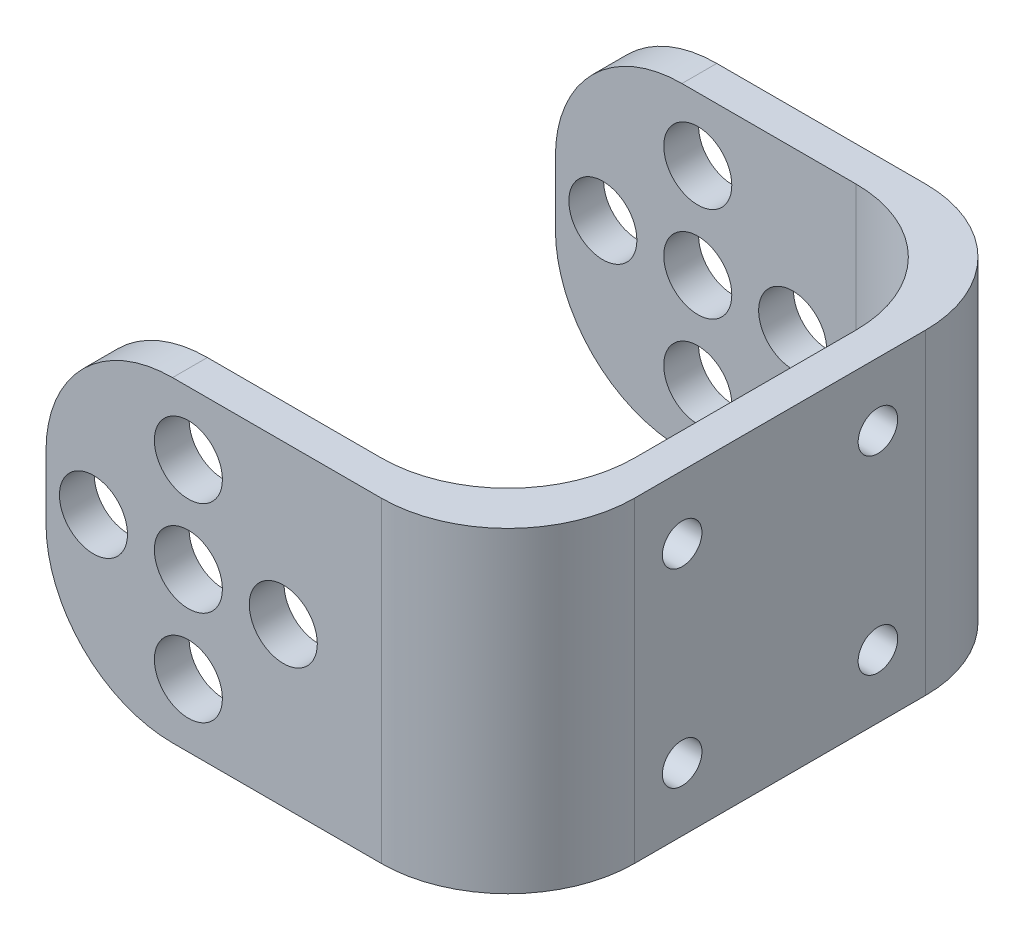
from build123d import *

# Parameters (mm, degrees)
BOSS_EXTRUDE1_DEPTH = 10
SKETCH3_R           = 2.15
CUT_EXTRUDE2_DEPTH  = 40.799944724
SKETCH5_R           = 1.25
CUT_EXTRUDE3_DEPTH  = 36.333836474


with BuildPart() as part:
    # Sketch2 → Boss-Extrude1 (new, symmetric)
    with BuildSketch(Plane(origin=(0, 0, 0), x_dir=(1, 0, 0), z_dir=(0, 1, 0))):
        with BuildLine():
            Line((-11.86, 17.2), (9.34, 17.2))
            ThreePointArc((9.34, 17.2), (14.996854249, 14.856854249), (17.34, 9.2))
            Line((17.34, 9.2), (17.34, -9.2))
            ThreePointArc((17.34, -9.2), (14.996854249, -14.856854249), (9.34, -17.2))
            Line((9.34, -17.2), (-11.86, -17.2))
            Line((-11.86, -17.2), (-11.86, -15))
            Line((-11.86, -15), (7.14, -15))
            ThreePointArc((7.14, -15), (12.796854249, -12.656854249), (15.14, -7))
            Line((15.14, -7), (15.14, 7))
            ThreePointArc((15.14, 7), (12.796854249, 12.656854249), (7.14, 15))
            Line((7.14, 15), (-11.86, 15))
            Line((-11.86, 15), (-11.86, 17.2))
        make_face()
    extrude(amount=BOSS_EXTRUDE1_DEPTH, both=True)

    # Sketch3 → Cut-Extrude2 (cut, through all)
    with BuildSketch(Plane.XY.offset(17.2)):
        with Locations((-2.86, 0)):
            Circle(SKETCH3_R)
        with Locations((-2.86, -6)):
            Circle(SKETCH3_R)
        with Locations((-2.86, 6)):
            Circle(SKETCH3_R)
        with Locations((3.14, 0)):
            Circle(SKETCH3_R)
        with Locations((-8.86, 0)):
            Circle(SKETCH3_R)
        with BuildLine():
            Line((-11.86, 10), (-11.86, 2))
            ThreePointArc((-11.86, 2), (-9.516854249, 7.656854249), (-3.86, 10))
            Line((-3.86, 10), (-11.86, 10))
        make_face()
        with BuildLine():
            Line((-11.86, -10), (-3.86, -10))
            ThreePointArc((-3.86, -10), (-9.516854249, -7.656854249), (-11.86, -2))
            Line((-11.86, -2), (-11.86, -10))
        make_face()
    extrude(amount=-CUT_EXTRUDE2_DEPTH, mode=Mode.SUBTRACT)

    # Sketch5 → Cut-Extrude3 (cut, through all)
    with BuildSketch(Plane(origin=(17.34, 0, 0), x_dir=(0, 0, -1), z_dir=(1, 0, 0))):
        with Locations((-6.187, 6)):
            Circle(SKETCH5_R)
        with Locations((6.187, 6)):
            Circle(SKETCH5_R)
        with Locations((-6.187, -6)):
            Circle(SKETCH5_R)
        with Locations((6.187, -6)):
            Circle(SKETCH5_R)
    extrude(amount=-CUT_EXTRUDE3_DEPTH, mode=Mode.SUBTRACT)


solid = part.part
